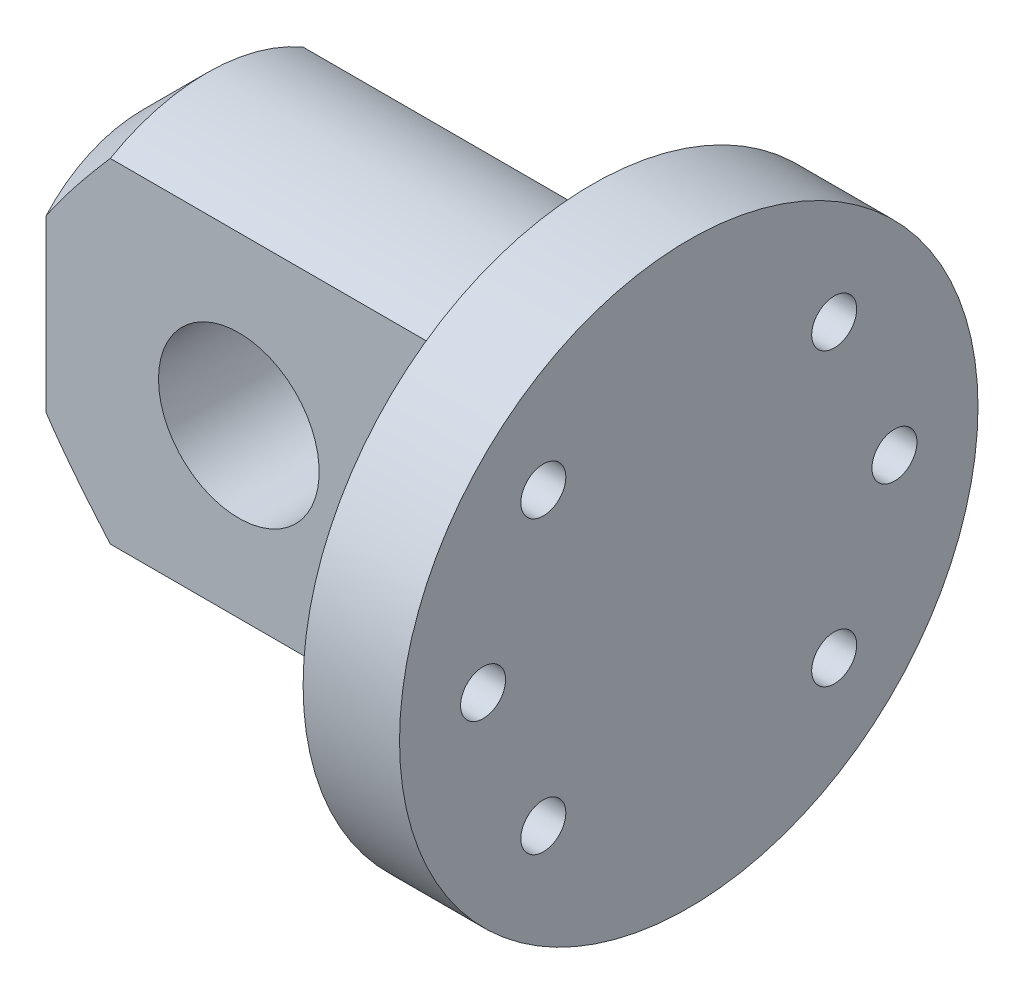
ISO-10303-21;
HEADER;
FILE_DESCRIPTION(('STEP AP214'),'2;1');
FILE_NAME('part.step','',(''),(''),'','','');
FILE_SCHEMA(('AUTOMOTIVE_DESIGN { 1 0 10303 214 1 1 1 1 }'));
ENDSEC;
DATA;
#1=APPLICATION_CONTEXT('core data for automotive mechanical design processes');
#2=APPLICATION_PROTOCOL_DEFINITION('international standard','automotive_design',2000,#1);
#3=PRODUCT_CONTEXT('',#1,'mechanical');
#4=PRODUCT('Part','Part','',(#3));
#5=PRODUCT_RELATED_PRODUCT_CATEGORY('part','',(#4));
#6=PRODUCT_DEFINITION_FORMATION('','',#4);
#7=PRODUCT_DEFINITION_CONTEXT('part definition',#1,'design');
#8=PRODUCT_DEFINITION('design','',#6,#7);
#9=PRODUCT_DEFINITION_SHAPE('','',#8);
#10=(LENGTH_UNIT() NAMED_UNIT(*) SI_UNIT(.MILLI.,.METRE.));
#11=(NAMED_UNIT(*) PLANE_ANGLE_UNIT() SI_UNIT($,.RADIAN.));
#12=(NAMED_UNIT(*) SI_UNIT($,.STERADIAN.) SOLID_ANGLE_UNIT());
#13=UNCERTAINTY_MEASURE_WITH_UNIT(LENGTH_MEASURE(1.E-05),#10,'distance_accuracy_value','');
#14=(GEOMETRIC_REPRESENTATION_CONTEXT(3) GLOBAL_UNCERTAINTY_ASSIGNED_CONTEXT((#13)) GLOBAL_UNIT_ASSIGNED_CONTEXT((#10,
#11,#12)) REPRESENTATION_CONTEXT('',''));
#15=CARTESIAN_POINT('',(0.,0.,0.));
#16=DIRECTION('',(0.,0.,1.));
#17=DIRECTION('',(1.,0.,0.));
#18=AXIS2_PLACEMENT_3D('',#15,#16,#17);
#19=CARTESIAN_POINT('',(-11.6180368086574,-21.0477458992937,0.));
#20=DIRECTION('',(1.,0.,0.));
#21=DIRECTION('',(0.,0.,-1.));
#22=AXIS2_PLACEMENT_3D('',#19,#20,#21);
#23=CONICAL_SURFACE('',#22,29.9999999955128,0.785398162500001);
#24=CARTESIAN_POINT('',(-11.6180368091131,4.93301621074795,15.0000000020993));
#25=CARTESIAN_POINT('',(-12.06039773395,4.4221694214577,15.0000000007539));
#26=CARTESIAN_POINT('',(-12.500950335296,3.90974504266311,15.000000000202));
#27=CARTESIAN_POINT('',(-13.377666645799,2.88113990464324,14.999999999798));
#28=CARTESIAN_POINT('',(-13.8138302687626,2.36495907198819,14.9999999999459));
#29=CARTESIAN_POINT('',(-14.6805685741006,1.32875044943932,15.000000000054));
#30=CARTESIAN_POINT('',(-15.1111481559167,0.808726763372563,15.0000000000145));
#31=CARTESIAN_POINT('',(-15.9661124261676,-0.236411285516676,14.9999999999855));
#32=CARTESIAN_POINT('',(-16.3904970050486,-0.761525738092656,14.9999999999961));
#33=CARTESIAN_POINT('',(-17.2320009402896,-1.81805923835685,15.0000000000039));
#34=CARTESIAN_POINT('',(-17.6491158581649,-2.34948182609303,15.000000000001));
#35=CARTESIAN_POINT('',(-18.4741037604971,-3.41942173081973,14.999999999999));
#36=CARTESIAN_POINT('',(-18.8819773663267,-3.95793856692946,14.9999999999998));
#37=CARTESIAN_POINT('',(-19.4853612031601,-4.77235024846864,15.0000000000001));
#38=CARTESIAN_POINT('',(-19.6851776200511,-5.04505798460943,15.));
#39=CARTESIAN_POINT('',(-20.0815740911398,-5.59281234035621,15.));
#40=CARTESIAN_POINT('',(-20.2781541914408,-5.86785892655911,15.));
#41=CARTESIAN_POINT('',(-20.667726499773,-6.42057968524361,15.));
#42=CARTESIAN_POINT('',(-20.8607178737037,-6.69825444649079,15.));
#43=CARTESIAN_POINT('',(-21.2425872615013,-7.25643698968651,15.));
#44=CARTESIAN_POINT('',(-21.4314650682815,-7.53694491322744,15.));
#45=CARTESIAN_POINT('',(-21.6180368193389,-7.8189893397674,15.));
#46=B_SPLINE_CURVE_WITH_KNOTS('',3,(#24,#25,#26,#27,#28,#29,#30,#31,#32,#33,#34,#35,#36,#37,#38,
#39,#40,#41,#42,#43,#44,#45),.UNSPECIFIED.,.F.,.F.,(4,2,2,2,2,2,2,2,2,2,4),(0.,2.02728019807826,
4.05460013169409,6.08000109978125,8.10543784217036,10.1320707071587,12.1585668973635,
13.1727788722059,14.1869763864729,15.2014067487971,16.2158880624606),.UNSPECIFIED.);
#47=CARTESIAN_POINT('',(-11.6180368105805,4.93301621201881,15.));
#48=VERTEX_POINT('',#47);
#49=CARTESIAN_POINT('',(-21.6180368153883,-7.8189893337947,15.));
#50=VERTEX_POINT('',#49);
#51=EDGE_CURVE('E95',#48,#50,#46,.T.);
#52=ORIENTED_EDGE('',*,*,#51,.F.);
#53=CARTESIAN_POINT('',(-11.6180368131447,-21.0477458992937,0.));
#54=DIRECTION('',(1.,0.,0.));
#55=DIRECTION('',(0.,0.,-1.));
#56=AXIS2_PLACEMENT_3D('',#53,#54,#55);
#57=CIRCLE('',#56,30.);
#58=CARTESIAN_POINT('',(-11.6180368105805,4.93301621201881,-15.));
#59=VERTEX_POINT('',#58);
#60=EDGE_CURVE('E81',#59,#48,#57,.T.);
#61=ORIENTED_EDGE('',*,*,#60,.F.);
#62=CARTESIAN_POINT('',(-21.6180368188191,-7.81898934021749,-14.9999999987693));
#63=CARTESIAN_POINT('',(-21.431465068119,-7.53694491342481,-14.999999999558));
#64=CARTESIAN_POINT('',(-21.2425872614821,-7.25643698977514,-14.9999999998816));
#65=CARTESIAN_POINT('',(-20.8607178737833,-6.69825444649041,-15.0000000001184));
#66=CARTESIAN_POINT('',(-20.6677264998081,-6.42057968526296,-15.0000000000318));
#67=CARTESIAN_POINT('',(-20.2781541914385,-5.86785892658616,-14.9999999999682));
#68=CARTESIAN_POINT('',(-20.0815740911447,-5.59281234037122,-14.9999999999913));
#69=CARTESIAN_POINT('',(-19.6851776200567,-5.04505798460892,-15.0000000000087));
#70=CARTESIAN_POINT('',(-19.4853612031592,-4.77235024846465,-15.000000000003));
#71=CARTESIAN_POINT('',(-18.8819773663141,-3.95793856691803,-14.9999999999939));
#72=CARTESIAN_POINT('',(-18.4741037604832,-3.41942173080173,-14.9999999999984));
#73=CARTESIAN_POINT('',(-17.6491158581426,-2.34948182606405,-15.0000000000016));
#74=CARTESIAN_POINT('',(-17.2320009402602,-1.81805923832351,-15.0000000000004));
#75=CARTESIAN_POINT('',(-16.390497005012,-0.761525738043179,-14.9999999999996));
#76=CARTESIAN_POINT('',(-15.9661124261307,-0.236411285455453,-14.9999999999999));
#77=CARTESIAN_POINT('',(-15.1111481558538,0.808726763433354,-15.0000000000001));
#78=CARTESIAN_POINT('',(-14.6805685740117,1.32875044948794,-15.));
#79=CARTESIAN_POINT('',(-13.8138302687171,2.36495907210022,-15.));
#80=CARTESIAN_POINT('',(-13.377666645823,2.8811399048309,-15.));
#81=CARTESIAN_POINT('',(-12.5009503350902,3.90974504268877,-15.));
#82=CARTESIAN_POINT('',(-12.060397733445,4.42216942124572,-15.));
#83=CARTESIAN_POINT('',(-11.6180368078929,4.93301620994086,-15.));
#84=B_SPLINE_CURVE_WITH_KNOTS('',3,(#62,#63,#64,#65,#66,#67,#68,#69,#70,#71,#72,#73,#74,#75,#76,
#77,#78,#79,#80,#81,#82,#83),.UNSPECIFIED.,.F.,.F.,(4,2,2,2,2,2,2,2,2,2,4),(0.,1.01448131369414,
2.02891167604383,3.04310919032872,4.05732116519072,6.08381735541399,8.11045022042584,
10.1358869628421,12.1612879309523,14.1886078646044,16.215888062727),.UNSPECIFIED.);
#85=CARTESIAN_POINT('',(-21.6180368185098,-7.81898933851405,-15.));
#86=VERTEX_POINT('',#85);
#87=EDGE_CURVE('E80',#86,#59,#84,.T.);
#88=ORIENTED_EDGE('',*,*,#87,.F.);
#89=CARTESIAN_POINT('',(-21.6180368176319,-21.0477458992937,0.));
#90=DIRECTION('',(1.,0.,0.));
#91=DIRECTION('',(0.,0.,-1.));
#92=AXIS2_PLACEMENT_3D('',#89,#90,#91);
#93=CIRCLE('',#92,20.0000000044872);
#94=EDGE_CURVE('E20',#50,#86,#93,.F.);
#95=ORIENTED_EDGE('',*,*,#94,.F.);
#96=EDGE_LOOP('',(#52,#61,#88,#95));
#97=FACE_BOUND('',#96,.T.);
#98=ADVANCED_FACE('F16',(#97),#23,.T.);
#99=CARTESIAN_POINT('',(-21.6180368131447,-6.04774589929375,0.));
#100=DIRECTION('',(-1.,0.,0.));
#101=DIRECTION('',(0.,0.,1.));
#102=AXIS2_PLACEMENT_3D('',#99,#100,#101);
#103=PLANE('',#102);
#104=DIRECTION('',(0.,1.,0.));
#105=VECTOR('',#104,1.);
#106=CARTESIAN_POINT('',(-21.6180368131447,-21.1819452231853,15.));
#107=LINE('',#106,#105);
#108=CARTESIAN_POINT('',(-21.6180368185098,-34.2765024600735,15.));
#109=VERTEX_POINT('',#108);
#110=EDGE_CURVE('E74',#50,#109,#107,.F.);
#111=ORIENTED_EDGE('',*,*,#110,.F.);
#112=ORIENTED_EDGE('',*,*,#94,.T.);
#113=DIRECTION('',(0.,1.,0.));
#114=VECTOR('',#113,1.);
#115=CARTESIAN_POINT('',(-21.6180368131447,-21.0477458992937,-15.));
#116=LINE('',#115,#114);
#117=CARTESIAN_POINT('',(-21.6180368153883,-34.2765024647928,-15.));
#118=VERTEX_POINT('',#117);
#119=EDGE_CURVE('E71',#118,#86,#116,.T.);
#120=ORIENTED_EDGE('',*,*,#119,.F.);
#121=CARTESIAN_POINT('',(-21.6180368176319,-21.0477458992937,0.));
#122=DIRECTION('',(1.,0.,0.));
#123=DIRECTION('',(0.,0.,-1.));
#124=AXIS2_PLACEMENT_3D('',#121,#122,#123);
#125=CIRCLE('',#124,20.0000000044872);
#126=EDGE_CURVE('E78',#109,#118,#125,.T.);
#127=ORIENTED_EDGE('',*,*,#126,.F.);
#128=EDGE_LOOP('',(#111,#112,#120,#127));
#129=FACE_BOUND('',#128,.T.);
#130=ADVANCED_FACE('F69',(#129),#103,.T.);
#131=CARTESIAN_POINT('',(8.38196318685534,-21.0477458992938,15.));
#132=DIRECTION('',(0.,0.,-1.));
#133=DIRECTION('',(-1.,0.,0.));
#134=AXIS2_PLACEMENT_3D('',#131,#132,#133);
#135=CYLINDRICAL_SURFACE('',#134,12.5);
#136=CARTESIAN_POINT('',(8.38196318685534,-21.0477458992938,15.));
#137=DIRECTION('',(0.,0.,-1.));
#138=DIRECTION('',(-1.,0.,0.));
#139=AXIS2_PLACEMENT_3D('',#136,#137,#138);
#140=CIRCLE('',#139,12.5);
#141=CARTESIAN_POINT('',(-4.11803681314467,-21.0477458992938,15.));
#142=VERTEX_POINT('',#141);
#143=EDGE_CURVE('E131',#142,#142,#140,.T.);
#144=ORIENTED_EDGE('',*,*,#143,.F.);
#145=EDGE_LOOP('',(#144));
#146=FACE_BOUND('',#145,.T.);
#147=CARTESIAN_POINT('',(8.38196318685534,-21.0477458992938,-15.));
#148=DIRECTION('',(0.,0.,-1.));
#149=DIRECTION('',(-1.,0.,0.));
#150=AXIS2_PLACEMENT_3D('',#147,#148,#149);
#151=CIRCLE('',#150,12.5);
#152=CARTESIAN_POINT('',(-4.11803681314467,-21.0477458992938,-15.));
#153=VERTEX_POINT('',#152);
#154=EDGE_CURVE('E85',#153,#153,#151,.F.);
#155=ORIENTED_EDGE('',*,*,#154,.F.);
#156=EDGE_LOOP('',(#155));
#157=FACE_BOUND('',#156,.T.);
#158=ADVANCED_FACE('F202',(#146,#157),#135,.F.);
#159=CARTESIAN_POINT('',(-11.6180368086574,-21.0477458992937,0.));
#160=DIRECTION('',(1.,0.,0.));
#161=DIRECTION('',(0.,0.,-1.));
#162=AXIS2_PLACEMENT_3D('',#159,#160,#161);
#163=CONICAL_SURFACE('',#162,29.9999999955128,0.785398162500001);
#164=CARTESIAN_POINT('',(-11.6180368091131,-47.0285080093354,-15.0000000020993));
#165=CARTESIAN_POINT('',(-12.06039773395,-46.5176612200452,-15.0000000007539));
#166=CARTESIAN_POINT('',(-12.500950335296,-46.0052368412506,-15.000000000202));
#167=CARTESIAN_POINT('',(-13.377666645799,-44.9766317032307,-14.999999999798));
#168=CARTESIAN_POINT('',(-13.8138302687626,-44.4604508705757,-14.9999999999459));
#169=CARTESIAN_POINT('',(-14.6805685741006,-43.4242422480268,-15.000000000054));
#170=CARTESIAN_POINT('',(-15.1111481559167,-42.9042185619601,-15.0000000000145));
#171=CARTESIAN_POINT('',(-15.9661124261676,-41.8590805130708,-14.9999999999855));
#172=CARTESIAN_POINT('',(-16.3904970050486,-41.3339660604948,-14.9999999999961));
#173=CARTESIAN_POINT('',(-17.2320009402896,-40.2774325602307,-15.0000000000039));
#174=CARTESIAN_POINT('',(-17.6491158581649,-39.7460099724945,-15.000000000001));
#175=CARTESIAN_POINT('',(-18.4741037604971,-38.6760700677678,-14.999999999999));
#176=CARTESIAN_POINT('',(-18.8819773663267,-38.137553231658,-14.9999999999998));
#177=CARTESIAN_POINT('',(-19.4853612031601,-37.3231415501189,-15.0000000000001));
#178=CARTESIAN_POINT('',(-19.6851776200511,-37.0504338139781,-15.));
#179=CARTESIAN_POINT('',(-20.0815740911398,-36.5026794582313,-15.));
#180=CARTESIAN_POINT('',(-20.2781541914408,-36.2276328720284,-15.));
#181=CARTESIAN_POINT('',(-20.667726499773,-35.6749121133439,-15.));
#182=CARTESIAN_POINT('',(-20.8607178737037,-35.3972373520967,-15.));
#183=CARTESIAN_POINT('',(-21.2425872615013,-34.839054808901,-15.));
#184=CARTESIAN_POINT('',(-21.4314650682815,-34.5585468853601,-15.));
#185=CARTESIAN_POINT('',(-21.6180368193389,-34.2765024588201,-15.));
#186=B_SPLINE_CURVE_WITH_KNOTS('',3,(#164,#165,#166,#167,#168,#169,#170,#171,#172,#173,#174,
#175,#176,#177,#178,#179,#180,#181,#182,#183,#184,#185),.UNSPECIFIED.,.F.,.F.,(4,2,2,2,2,2,2,2,
2,2,4),(0.,2.02728019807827,4.05460013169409,6.08000109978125,8.10543784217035,10.1320707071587,
12.1585668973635,13.1727788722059,14.1869763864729,15.2014067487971,16.2158880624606),.UNSPECIFIED.);
#187=CARTESIAN_POINT('',(-11.6180368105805,-47.0285080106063,-15.));
#188=VERTEX_POINT('',#187);
#189=EDGE_CURVE('E89',#188,#118,#186,.T.);
#190=ORIENTED_EDGE('',*,*,#189,.F.);
#191=CARTESIAN_POINT('',(-11.6180368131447,-21.0477458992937,0.));
#192=DIRECTION('',(1.,0.,0.));
#193=DIRECTION('',(0.,0.,-1.));
#194=AXIS2_PLACEMENT_3D('',#191,#192,#193);
#195=CIRCLE('',#194,30.);
#196=CARTESIAN_POINT('',(-11.6180368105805,-47.0285080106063,15.));
#197=VERTEX_POINT('',#196);
#198=EDGE_CURVE('E128',#197,#188,#195,.T.);
#199=ORIENTED_EDGE('',*,*,#198,.F.);
#200=CARTESIAN_POINT('',(-21.6180368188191,-34.27650245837,14.9999999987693));
#201=CARTESIAN_POINT('',(-21.431465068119,-34.5585468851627,14.999999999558));
#202=CARTESIAN_POINT('',(-21.2425872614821,-34.8390548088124,14.9999999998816));
#203=CARTESIAN_POINT('',(-20.8607178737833,-35.3972373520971,15.0000000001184));
#204=CARTESIAN_POINT('',(-20.6677264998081,-35.6749121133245,15.0000000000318));
#205=CARTESIAN_POINT('',(-20.2781541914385,-36.2276328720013,14.9999999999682));
#206=CARTESIAN_POINT('',(-20.0815740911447,-36.5026794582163,14.9999999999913));
#207=CARTESIAN_POINT('',(-19.6851776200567,-37.0504338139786,15.0000000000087));
#208=CARTESIAN_POINT('',(-19.4853612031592,-37.3231415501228,15.000000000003));
#209=CARTESIAN_POINT('',(-18.8819773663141,-38.1375532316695,14.9999999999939));
#210=CARTESIAN_POINT('',(-18.4741037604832,-38.6760700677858,14.9999999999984));
#211=CARTESIAN_POINT('',(-17.6491158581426,-39.7460099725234,15.0000000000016));
#212=CARTESIAN_POINT('',(-17.2320009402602,-40.277432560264,15.0000000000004));
#213=CARTESIAN_POINT('',(-16.390497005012,-41.3339660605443,14.9999999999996));
#214=CARTESIAN_POINT('',(-15.9661124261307,-41.859080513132,14.9999999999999));
#215=CARTESIAN_POINT('',(-15.1111481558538,-42.9042185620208,15.0000000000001));
#216=CARTESIAN_POINT('',(-14.6805685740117,-43.4242422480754,15.));
#217=CARTESIAN_POINT('',(-13.8138302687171,-44.4604508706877,15.));
#218=CARTESIAN_POINT('',(-13.3776666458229,-44.9766317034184,15.));
#219=CARTESIAN_POINT('',(-12.5009503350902,-46.0052368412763,15.));
#220=CARTESIAN_POINT('',(-12.060397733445,-46.5176612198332,15.));
#221=CARTESIAN_POINT('',(-11.6180368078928,-47.0285080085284,15.));
#222=B_SPLINE_CURVE_WITH_KNOTS('',3,(#200,#201,#202,#203,#204,#205,#206,#207,#208,#209,#210,
#211,#212,#213,#214,#215,#216,#217,#218,#219,#220,#221),.UNSPECIFIED.,.F.,.F.,(4,2,2,2,2,2,2,2,
2,2,4),(0.,1.01448131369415,2.02891167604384,3.04310919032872,4.05732116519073,6.083817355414,
8.11045022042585,10.1358869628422,12.1612879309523,14.1886078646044,16.215888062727),.UNSPECIFIED.);
#223=EDGE_CURVE('E94',#109,#197,#222,.T.);
#224=ORIENTED_EDGE('',*,*,#223,.F.);
#225=ORIENTED_EDGE('',*,*,#126,.T.);
#226=EDGE_LOOP('',(#190,#199,#224,#225));
#227=FACE_BOUND('',#226,.T.);
#228=ADVANCED_FACE('F198',(#227),#163,.T.);
#229=CARTESIAN_POINT('',(-21.6180368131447,4.93301621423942,-15.));
#230=DIRECTION('',(0.,0.,-1.));
#231=DIRECTION('',(1.,0.,0.));
#232=AXIS2_PLACEMENT_3D('',#229,#230,#231);
#233=PLANE('',#232);
#234=ORIENTED_EDGE('',*,*,#154,.T.);
#235=EDGE_LOOP('',(#234));
#236=FACE_BOUND('',#235,.T.);
#237=DIRECTION('',(1.,0.,0.));
#238=VECTOR('',#237,1.);
#239=CARTESIAN_POINT('',(13.3819631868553,4.93301621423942,-15.));
#240=LINE('',#239,#238);
#241=CARTESIAN_POINT('',(48.3819631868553,4.93301621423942,-15.));
#242=VERTEX_POINT('',#241);
#243=EDGE_CURVE('E132',#242,#59,#240,.F.);
#244=ORIENTED_EDGE('',*,*,#243,.F.);
#245=DIRECTION('',(0.,1.,0.));
#246=VECTOR('',#245,1.);
#247=CARTESIAN_POINT('',(48.3819631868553,16.4522541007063,-15.));
#248=LINE('',#247,#246);
#249=CARTESIAN_POINT('',(48.3819631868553,-47.0285080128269,-15.));
#250=VERTEX_POINT('',#249);
#251=EDGE_CURVE('E103',#250,#242,#248,.T.);
#252=ORIENTED_EDGE('',*,*,#251,.F.);
#253=DIRECTION('',(1.,0.,0.));
#254=VECTOR('',#253,1.);
#255=CARTESIAN_POINT('',(13.3819631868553,-47.0285080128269,-15.));
#256=LINE('',#255,#254);
#257=EDGE_CURVE('E106',#188,#250,#256,.T.);
#258=ORIENTED_EDGE('',*,*,#257,.F.);
#259=ORIENTED_EDGE('',*,*,#189,.T.);
#260=ORIENTED_EDGE('',*,*,#119,.T.);
#261=ORIENTED_EDGE('',*,*,#87,.T.);
#262=EDGE_LOOP('',(#244,#252,#258,#259,#260,#261));
#263=FACE_BOUND('',#262,.T.);
#264=ADVANCED_FACE('F87',(#236,#263),#233,.T.);
#265=CARTESIAN_POINT('',(13.3819631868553,-21.0477458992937,0.));
#266=DIRECTION('',(1.,0.,0.));
#267=DIRECTION('',(0.,0.,-1.));
#268=AXIS2_PLACEMENT_3D('',#265,#266,#267);
#269=CYLINDRICAL_SURFACE('',#268,30.);
#270=DIRECTION('',(1.,0.,0.));
#271=VECTOR('',#270,1.);
#272=CARTESIAN_POINT('',(10.0696850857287,4.93301621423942,15.));
#273=LINE('',#272,#271);
#274=CARTESIAN_POINT('',(48.3819631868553,4.93301621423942,15.));
#275=VERTEX_POINT('',#274);
#276=EDGE_CURVE('E96',#275,#48,#273,.F.);
#277=ORIENTED_EDGE('',*,*,#276,.F.);
#278=CARTESIAN_POINT('',(48.3819631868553,-21.0477458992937,0.));
#279=DIRECTION('',(1.,0.,0.));
#280=DIRECTION('',(0.,0.,-1.));
#281=AXIS2_PLACEMENT_3D('',#278,#279,#280);
#282=CIRCLE('',#281,30.);
#283=EDGE_CURVE('E102',#242,#275,#282,.T.);
#284=ORIENTED_EDGE('',*,*,#283,.F.);
#285=ORIENTED_EDGE('',*,*,#243,.T.);
#286=ORIENTED_EDGE('',*,*,#60,.T.);
#287=EDGE_LOOP('',(#277,#284,#285,#286));
#288=FACE_BOUND('',#287,.T.);
#289=ADVANCED_FACE('F204',(#288),#269,.T.);
#290=CARTESIAN_POINT('',(10.0696850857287,-21.1819452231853,15.));
#291=DIRECTION('',(0.,0.,1.));
#292=DIRECTION('',(1.,0.,0.));
#293=AXIS2_PLACEMENT_3D('',#290,#291,#292);
#294=PLANE('',#293);
#295=ORIENTED_EDGE('',*,*,#143,.T.);
#296=EDGE_LOOP('',(#295));
#297=FACE_BOUND('',#296,.T.);
#298=DIRECTION('',(1.,0.,0.));
#299=VECTOR('',#298,1.);
#300=CARTESIAN_POINT('',(13.3819631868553,-47.0285080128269,15.));
#301=LINE('',#300,#299);
#302=CARTESIAN_POINT('',(48.3819631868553,-47.0285080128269,15.));
#303=VERTEX_POINT('',#302);
#304=EDGE_CURVE('E129',#303,#197,#301,.F.);
#305=ORIENTED_EDGE('',*,*,#304,.F.);
#306=DIRECTION('',(0.,1.,0.));
#307=VECTOR('',#306,1.);
#308=CARTESIAN_POINT('',(48.3819631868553,16.4522541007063,15.));
#309=LINE('',#308,#307);
#310=EDGE_CURVE('E99',#275,#303,#309,.F.);
#311=ORIENTED_EDGE('',*,*,#310,.F.);
#312=ORIENTED_EDGE('',*,*,#276,.T.);
#313=ORIENTED_EDGE('',*,*,#51,.T.);
#314=ORIENTED_EDGE('',*,*,#110,.T.);
#315=ORIENTED_EDGE('',*,*,#223,.T.);
#316=EDGE_LOOP('',(#305,#311,#312,#313,#314,#315));
#317=FACE_BOUND('',#316,.T.);
#318=ADVANCED_FACE('F194',(#297,#317),#294,.T.);
#319=CARTESIAN_POINT('',(13.3819631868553,-21.0477458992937,0.));
#320=DIRECTION('',(1.,0.,0.));
#321=DIRECTION('',(0.,0.,-1.));
#322=AXIS2_PLACEMENT_3D('',#319,#320,#321);
#323=CYLINDRICAL_SURFACE('',#322,30.);
#324=ORIENTED_EDGE('',*,*,#257,.T.);
#325=CARTESIAN_POINT('',(48.3819631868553,-21.0477458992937,0.));
#326=DIRECTION('',(1.,0.,0.));
#327=DIRECTION('',(0.,0.,-1.));
#328=AXIS2_PLACEMENT_3D('',#325,#326,#327);
#329=CIRCLE('',#328,30.);
#330=EDGE_CURVE('E35',#303,#250,#329,.T.);
#331=ORIENTED_EDGE('',*,*,#330,.F.);
#332=ORIENTED_EDGE('',*,*,#304,.T.);
#333=ORIENTED_EDGE('',*,*,#198,.T.);
#334=EDGE_LOOP('',(#324,#331,#332,#333));
#335=FACE_BOUND('',#334,.T.);
#336=ADVANCED_FACE('F280',(#335),#323,.T.);
#337=CARTESIAN_POINT('',(48.3819631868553,16.4522541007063,0.));
#338=DIRECTION('',(-1.,0.,0.));
#339=DIRECTION('',(0.,0.,1.));
#340=AXIS2_PLACEMENT_3D('',#337,#338,#339);
#341=PLANE('',#340);
#342=CARTESIAN_POINT('',(48.3819631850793,-21.0477458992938,-32.));
#343=DIRECTION('',(-1.,0.,0.));
#344=DIRECTION('',(0.,0.,1.));
#345=AXIS2_PLACEMENT_3D('',#342,#343,#344);
#346=CIRCLE('',#345,7.49999999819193);
#347=CARTESIAN_POINT('',(48.3819631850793,-21.0477458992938,-24.5000000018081));
#348=VERTEX_POINT('',#347);
#349=EDGE_CURVE('E168',#348,#348,#346,.F.);
#350=ORIENTED_EDGE('',*,*,#349,.T.);
#351=EDGE_LOOP('',(#350));
#352=FACE_BOUND('',#351,.T.);
#353=CARTESIAN_POINT('',(48.3819631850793,-43.6751628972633,22.6274169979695));
#354=DIRECTION('',(-1.,0.,0.));
#355=DIRECTION('',(0.,0.,1.));
#356=AXIS2_PLACEMENT_3D('',#353,#354,#355);
#357=CIRCLE('',#356,7.4999999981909);
#358=CARTESIAN_POINT('',(48.3819631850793,-43.6751628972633,30.1274169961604));
#359=VERTEX_POINT('',#358);
#360=EDGE_CURVE('E165',#359,#359,#357,.F.);
#361=ORIENTED_EDGE('',*,*,#360,.T.);
#362=EDGE_LOOP('',(#361));
#363=FACE_BOUND('',#362,.T.);
#364=CARTESIAN_POINT('',(48.3819631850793,1.57967109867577,22.6274169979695));
#365=DIRECTION('',(-1.,0.,0.));
#366=DIRECTION('',(0.,0.,1.));
#367=AXIS2_PLACEMENT_3D('',#364,#365,#366);
#368=CIRCLE('',#367,7.49999999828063);
#369=CARTESIAN_POINT('',(48.3819631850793,1.57967109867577,30.1274169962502));
#370=VERTEX_POINT('',#369);
#371=EDGE_CURVE('E162',#370,#370,#368,.F.);
#372=ORIENTED_EDGE('',*,*,#371,.T.);
#373=EDGE_LOOP('',(#372));
#374=FACE_BOUND('',#373,.T.);
#375=ORIENTED_EDGE('',*,*,#310,.T.);
#376=ORIENTED_EDGE('',*,*,#330,.T.);
#377=ORIENTED_EDGE('',*,*,#251,.T.);
#378=ORIENTED_EDGE('',*,*,#283,.T.);
#379=EDGE_LOOP('',(#375,#376,#377,#378));
#380=FACE_BOUND('',#379,.T.);
#381=CARTESIAN_POINT('',(48.3819631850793,-21.0477458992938,32.));
#382=DIRECTION('',(-1.,0.,0.));
#383=DIRECTION('',(0.,0.,1.));
#384=AXIS2_PLACEMENT_3D('',#381,#382,#383);
#385=CIRCLE('',#384,7.49999999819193);
#386=CARTESIAN_POINT('',(48.3819631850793,-21.0477458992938,39.4999999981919));
#387=VERTEX_POINT('',#386);
#388=EDGE_CURVE('E159',#387,#387,#385,.F.);
#389=ORIENTED_EDGE('',*,*,#388,.T.);
#390=EDGE_LOOP('',(#389));
#391=FACE_BOUND('',#390,.T.);
#392=CARTESIAN_POINT('',(48.3819631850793,-43.6751628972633,-22.6274169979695));
#393=DIRECTION('',(-1.,0.,0.));
#394=DIRECTION('',(0.,0.,1.));
#395=AXIS2_PLACEMENT_3D('',#392,#393,#394);
#396=CIRCLE('',#395,7.4999999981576);
#397=CARTESIAN_POINT('',(48.3819631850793,-43.6751628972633,-15.1274169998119));
#398=VERTEX_POINT('',#397);
#399=EDGE_CURVE('E174',#398,#398,#396,.F.);
#400=ORIENTED_EDGE('',*,*,#399,.T.);
#401=EDGE_LOOP('',(#400));
#402=FACE_BOUND('',#401,.T.);
#403=CARTESIAN_POINT('',(48.3819631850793,1.57967109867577,-22.6274169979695));
#404=DIRECTION('',(-1.,0.,0.));
#405=DIRECTION('',(0.,0.,1.));
#406=AXIS2_PLACEMENT_3D('',#403,#404,#405);
#407=CIRCLE('',#406,7.49999999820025);
#408=CARTESIAN_POINT('',(48.3819631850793,1.57967109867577,-15.1274169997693));
#409=VERTEX_POINT('',#408);
#410=EDGE_CURVE('E171',#409,#409,#407,.F.);
#411=ORIENTED_EDGE('',*,*,#410,.T.);
#412=EDGE_LOOP('',(#411));
#413=FACE_BOUND('',#412,.T.);
#414=CARTESIAN_POINT('',(48.3819631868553,-21.0477458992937,0.));
#415=DIRECTION('',(1.,0.,0.));
#416=DIRECTION('',(0.,0.,-1.));
#417=AXIS2_PLACEMENT_3D('',#414,#415,#416);
#418=CIRCLE('',#417,45.);
#419=CARTESIAN_POINT('',(48.3819631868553,-21.0477458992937,-45.));
#420=VERTEX_POINT('',#419);
#421=EDGE_CURVE('E126',#420,#420,#418,.T.);
#422=ORIENTED_EDGE('',*,*,#421,.F.);
#423=EDGE_LOOP('',(#422));
#424=FACE_BOUND('',#423,.T.);
#425=ADVANCED_FACE('F277',(#352,#363,#374,#380,#391,#402,#413,#424),#341,.T.);
#426=CARTESIAN_POINT('',(48.3819631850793,-43.6751628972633,-22.6274169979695));
#427=DIRECTION('',(-1.,0.,0.));
#428=DIRECTION('',(0.,0.,1.));
#429=AXIS2_PLACEMENT_3D('',#426,#427,#428);
#430=CONICAL_SURFACE('',#429,7.4999999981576,0.785398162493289);
#431=CARTESIAN_POINT('',(52.3819631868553,-43.6751628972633,-22.6274169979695));
#432=DIRECTION('',(1.,0.,0.));
#433=DIRECTION('',(0.,0.,-1.));
#434=AXIS2_PLACEMENT_3D('',#431,#432,#433);
#435=CIRCLE('',#434,3.5);
#436=CARTESIAN_POINT('',(52.3819631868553,-43.6751628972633,-26.1274169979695));
#437=VERTEX_POINT('',#436);
#438=EDGE_CURVE('E123',#437,#437,#435,.T.);
#439=ORIENTED_EDGE('',*,*,#438,.T.);
#440=EDGE_LOOP('',(#439));
#441=FACE_BOUND('',#440,.T.);
#442=ORIENTED_EDGE('',*,*,#399,.F.);
#443=EDGE_LOOP('',(#442));
#444=FACE_BOUND('',#443,.T.);
#445=ADVANCED_FACE('F273',(#441,#444),#430,.F.);
#446=CARTESIAN_POINT('',(48.3819631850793,1.57967109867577,-22.6274169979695));
#447=DIRECTION('',(-1.,0.,0.));
#448=DIRECTION('',(0.,0.,1.));
#449=AXIS2_PLACEMENT_3D('',#446,#447,#448);
#450=CONICAL_SURFACE('',#449,7.49999999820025,0.785398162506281);
#451=CARTESIAN_POINT('',(52.3819631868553,1.57967109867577,-22.6274169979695));
#452=DIRECTION('',(1.,0.,0.));
#453=DIRECTION('',(0.,0.,-1.));
#454=AXIS2_PLACEMENT_3D('',#451,#452,#453);
#455=CIRCLE('',#454,3.5);
#456=CARTESIAN_POINT('',(52.3819631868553,1.57967109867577,-26.1274169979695));
#457=VERTEX_POINT('',#456);
#458=EDGE_CURVE('E120',#457,#457,#455,.T.);
#459=ORIENTED_EDGE('',*,*,#458,.T.);
#460=EDGE_LOOP('',(#459));
#461=FACE_BOUND('',#460,.T.);
#462=ORIENTED_EDGE('',*,*,#410,.F.);
#463=EDGE_LOOP('',(#462));
#464=FACE_BOUND('',#463,.T.);
#465=ADVANCED_FACE('F269',(#461,#464),#450,.F.);
#466=CARTESIAN_POINT('',(48.3819631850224,-21.0477458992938,-32.));
#467=DIRECTION('',(-1.,0.,0.));
#468=DIRECTION('',(0.,0.,1.));
#469=AXIS2_PLACEMENT_3D('',#466,#467,#468);
#470=CONICAL_SURFACE('',#469,7.49999999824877,0.785398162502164);
#471=CARTESIAN_POINT('',(52.3819631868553,-21.0477458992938,-32.));
#472=DIRECTION('',(1.,0.,0.));
#473=DIRECTION('',(0.,0.,-1.));
#474=AXIS2_PLACEMENT_3D('',#471,#472,#473);
#475=CIRCLE('',#474,3.5);
#476=CARTESIAN_POINT('',(52.3819631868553,-21.0477458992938,-35.5));
#477=VERTEX_POINT('',#476);
#478=EDGE_CURVE('E117',#477,#477,#475,.T.);
#479=ORIENTED_EDGE('',*,*,#478,.T.);
#480=EDGE_LOOP('',(#479));
#481=FACE_BOUND('',#480,.T.);
#482=ORIENTED_EDGE('',*,*,#349,.F.);
#483=EDGE_LOOP('',(#482));
#484=FACE_BOUND('',#483,.T.);
#485=ADVANCED_FACE('F265',(#481,#484),#470,.F.);
#486=CARTESIAN_POINT('',(48.3819631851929,-43.6751628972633,22.6274169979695));
#487=DIRECTION('',(-1.,0.,0.));
#488=DIRECTION('',(0.,0.,1.));
#489=AXIS2_PLACEMENT_3D('',#486,#487,#488);
#490=CONICAL_SURFACE('',#489,7.49999999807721,0.785398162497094);
#491=CARTESIAN_POINT('',(52.3819631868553,-43.6751628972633,22.6274169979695));
#492=DIRECTION('',(1.,0.,0.));
#493=DIRECTION('',(0.,0.,-1.));
#494=AXIS2_PLACEMENT_3D('',#491,#492,#493);
#495=CIRCLE('',#494,3.5);
#496=CARTESIAN_POINT('',(52.3819631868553,-43.6751628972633,19.1274169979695));
#497=VERTEX_POINT('',#496);
#498=EDGE_CURVE('E114',#497,#497,#495,.T.);
#499=ORIENTED_EDGE('',*,*,#498,.T.);
#500=EDGE_LOOP('',(#499));
#501=FACE_BOUND('',#500,.T.);
#502=ORIENTED_EDGE('',*,*,#360,.F.);
#503=EDGE_LOOP('',(#502));
#504=FACE_BOUND('',#503,.T.);
#505=ADVANCED_FACE('F261',(#501,#504),#490,.F.);
#506=CARTESIAN_POINT('',(48.3819631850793,1.57967109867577,22.6274169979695));
#507=DIRECTION('',(-1.,0.,0.));
#508=DIRECTION('',(0.,0.,1.));
#509=AXIS2_PLACEMENT_3D('',#506,#507,#508);
#510=CONICAL_SURFACE('',#509,7.49999999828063,0.7853981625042);
#511=CARTESIAN_POINT('',(52.3819631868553,1.57967109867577,22.6274169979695));
#512=DIRECTION('',(1.,0.,0.));
#513=DIRECTION('',(0.,1.,0.));
#514=AXIS2_PLACEMENT_3D('',#511,#512,#513);
#515=CIRCLE('',#514,3.5);
#516=CARTESIAN_POINT('',(52.3819631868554,5.07967109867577,22.6274169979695));
#517=VERTEX_POINT('',#516);
#518=EDGE_CURVE('E111',#517,#517,#515,.T.);
#519=ORIENTED_EDGE('',*,*,#518,.T.);
#520=EDGE_LOOP('',(#519));
#521=FACE_BOUND('',#520,.T.);
#522=ORIENTED_EDGE('',*,*,#371,.F.);
#523=EDGE_LOOP('',(#522));
#524=FACE_BOUND('',#523,.T.);
#525=ADVANCED_FACE('F257',(#521,#524),#510,.F.);
#526=CARTESIAN_POINT('',(48.3819631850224,-21.0477458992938,32.));
#527=DIRECTION('',(-1.,0.,0.));
#528=DIRECTION('',(0.,0.,1.));
#529=AXIS2_PLACEMENT_3D('',#526,#527,#528);
#530=CONICAL_SURFACE('',#529,7.49999999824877,0.785398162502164);
#531=CARTESIAN_POINT('',(52.3819631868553,-21.0477458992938,32.));
#532=DIRECTION('',(1.,0.,0.));
#533=DIRECTION('',(0.,0.,-1.));
#534=AXIS2_PLACEMENT_3D('',#531,#532,#533);
#535=CIRCLE('',#534,3.5);
#536=CARTESIAN_POINT('',(52.3819631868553,-21.0477458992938,28.5));
#537=VERTEX_POINT('',#536);
#538=EDGE_CURVE('E107',#537,#537,#535,.T.);
#539=ORIENTED_EDGE('',*,*,#538,.T.);
#540=EDGE_LOOP('',(#539));
#541=FACE_BOUND('',#540,.T.);
#542=ORIENTED_EDGE('',*,*,#388,.F.);
#543=EDGE_LOOP('',(#542));
#544=FACE_BOUND('',#543,.T.);
#545=ADVANCED_FACE('F253',(#541,#544),#530,.F.);
#546=CARTESIAN_POINT('',(55.8819631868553,-21.0477458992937,0.));
#547=DIRECTION('',(1.,0.,0.));
#548=DIRECTION('',(0.,0.,-1.));
#549=AXIS2_PLACEMENT_3D('',#546,#547,#548);
#550=CYLINDRICAL_SURFACE('',#549,45.);
#551=CARTESIAN_POINT('',(63.3819631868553,-21.0477458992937,0.));
#552=DIRECTION('',(1.,0.,0.));
#553=DIRECTION('',(0.,0.,-1.));
#554=AXIS2_PLACEMENT_3D('',#551,#552,#553);
#555=CIRCLE('',#554,45.);
#556=CARTESIAN_POINT('',(63.3819631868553,-21.0477458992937,-45.));
#557=VERTEX_POINT('',#556);
#558=EDGE_CURVE('E110',#557,#557,#555,.T.);
#559=ORIENTED_EDGE('',*,*,#558,.F.);
#560=EDGE_LOOP('',(#559));
#561=FACE_BOUND('',#560,.T.);
#562=ORIENTED_EDGE('',*,*,#421,.T.);
#563=EDGE_LOOP('',(#562));
#564=FACE_BOUND('',#563,.T.);
#565=ADVANCED_FACE('F249',(#561,#564),#550,.T.);
#566=CARTESIAN_POINT('',(201.434241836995,-43.6751628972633,-22.6274169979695));
#567=DIRECTION('',(1.,0.,0.));
#568=DIRECTION('',(0.,0.,-1.));
#569=AXIS2_PLACEMENT_3D('',#566,#567,#568);
#570=CYLINDRICAL_SURFACE('',#569,3.5);
#571=ORIENTED_EDGE('',*,*,#438,.F.);
#572=EDGE_LOOP('',(#571));
#573=FACE_BOUND('',#572,.T.);
#574=CARTESIAN_POINT('',(63.3819631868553,-43.6751628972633,-22.6274169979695));
#575=DIRECTION('',(1.,0.,0.));
#576=DIRECTION('',(0.,0.,-1.));
#577=AXIS2_PLACEMENT_3D('',#574,#575,#576);
#578=CIRCLE('',#577,3.5);
#579=CARTESIAN_POINT('',(63.3819631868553,-43.6751628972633,-26.1274169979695));
#580=VERTEX_POINT('',#579);
#581=EDGE_CURVE('E152',#580,#580,#578,.F.);
#582=ORIENTED_EDGE('',*,*,#581,.F.);
#583=EDGE_LOOP('',(#582));
#584=FACE_BOUND('',#583,.T.);
#585=ADVANCED_FACE('F245',(#573,#584),#570,.F.);
#586=CARTESIAN_POINT('',(201.434241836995,1.57967109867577,-22.6274169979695));
#587=DIRECTION('',(1.,0.,0.));
#588=DIRECTION('',(0.,0.,-1.));
#589=AXIS2_PLACEMENT_3D('',#586,#587,#588);
#590=CYLINDRICAL_SURFACE('',#589,3.5);
#591=ORIENTED_EDGE('',*,*,#458,.F.);
#592=EDGE_LOOP('',(#591));
#593=FACE_BOUND('',#592,.T.);
#594=CARTESIAN_POINT('',(63.3819631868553,1.57967109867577,-22.6274169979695));
#595=DIRECTION('',(1.,0.,0.));
#596=DIRECTION('',(0.,0.,-1.));
#597=AXIS2_PLACEMENT_3D('',#594,#595,#596);
#598=CIRCLE('',#597,3.5);
#599=CARTESIAN_POINT('',(63.3819631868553,1.57967109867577,-26.1274169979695));
#600=VERTEX_POINT('',#599);
#601=EDGE_CURVE('E149',#600,#600,#598,.F.);
#602=ORIENTED_EDGE('',*,*,#601,.F.);
#603=EDGE_LOOP('',(#602));
#604=FACE_BOUND('',#603,.T.);
#605=ADVANCED_FACE('F241',(#593,#604),#590,.F.);
#606=CARTESIAN_POINT('',(201.434241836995,-21.0477458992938,-32.));
#607=DIRECTION('',(1.,0.,0.));
#608=DIRECTION('',(0.,0.,-1.));
#609=AXIS2_PLACEMENT_3D('',#606,#607,#608);
#610=CYLINDRICAL_SURFACE('',#609,3.5);
#611=ORIENTED_EDGE('',*,*,#478,.F.);
#612=EDGE_LOOP('',(#611));
#613=FACE_BOUND('',#612,.T.);
#614=CARTESIAN_POINT('',(63.3819631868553,-21.0477458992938,-32.));
#615=DIRECTION('',(1.,0.,0.));
#616=DIRECTION('',(0.,0.,-1.));
#617=AXIS2_PLACEMENT_3D('',#614,#615,#616);
#618=CIRCLE('',#617,3.5);
#619=CARTESIAN_POINT('',(63.3819631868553,-21.0477458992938,-35.5));
#620=VERTEX_POINT('',#619);
#621=EDGE_CURVE('E146',#620,#620,#618,.F.);
#622=ORIENTED_EDGE('',*,*,#621,.F.);
#623=EDGE_LOOP('',(#622));
#624=FACE_BOUND('',#623,.T.);
#625=ADVANCED_FACE('F223',(#613,#624),#610,.F.);
#626=CARTESIAN_POINT('',(52.3819631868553,-43.6751628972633,22.6274169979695));
#627=DIRECTION('',(1.,0.,0.));
#628=DIRECTION('',(0.,0.,-1.));
#629=AXIS2_PLACEMENT_3D('',#626,#627,#628);
#630=CYLINDRICAL_SURFACE('',#629,3.5);
#631=ORIENTED_EDGE('',*,*,#498,.F.);
#632=EDGE_LOOP('',(#631));
#633=FACE_BOUND('',#632,.T.);
#634=CARTESIAN_POINT('',(63.3819631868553,-43.6751628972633,22.6274169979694));
#635=DIRECTION('',(1.,0.,0.));
#636=DIRECTION('',(0.,0.,-1.));
#637=AXIS2_PLACEMENT_3D('',#634,#635,#636);
#638=CIRCLE('',#637,3.5);
#639=CARTESIAN_POINT('',(63.3819631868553,-43.6751628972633,19.1274169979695));
#640=VERTEX_POINT('',#639);
#641=EDGE_CURVE('E143',#640,#640,#638,.F.);
#642=ORIENTED_EDGE('',*,*,#641,.F.);
#643=EDGE_LOOP('',(#642));
#644=FACE_BOUND('',#643,.T.);
#645=ADVANCED_FACE('F219',(#633,#644),#630,.F.);
#646=CARTESIAN_POINT('',(52.3819631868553,1.57967109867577,22.6274169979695));
#647=DIRECTION('',(1.,0.,0.));
#648=DIRECTION('',(0.,1.,0.));
#649=AXIS2_PLACEMENT_3D('',#646,#647,#648);
#650=CYLINDRICAL_SURFACE('',#649,3.5);
#651=ORIENTED_EDGE('',*,*,#518,.F.);
#652=EDGE_LOOP('',(#651));
#653=FACE_BOUND('',#652,.T.);
#654=CARTESIAN_POINT('',(63.3819631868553,1.57967109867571,22.6274169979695));
#655=DIRECTION('',(1.,0.,0.));
#656=DIRECTION('',(0.,1.,0.));
#657=AXIS2_PLACEMENT_3D('',#654,#655,#656);
#658=CIRCLE('',#657,3.5);
#659=CARTESIAN_POINT('',(63.3819631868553,5.07967109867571,22.6274169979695));
#660=VERTEX_POINT('',#659);
#661=EDGE_CURVE('E26',#660,#660,#658,.F.);
#662=ORIENTED_EDGE('',*,*,#661,.F.);
#663=EDGE_LOOP('',(#662));
#664=FACE_BOUND('',#663,.T.);
#665=ADVANCED_FACE('F222',(#653,#664),#650,.F.);
#666=CARTESIAN_POINT('',(52.3819631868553,-21.0477458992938,32.));
#667=DIRECTION('',(1.,0.,0.));
#668=DIRECTION('',(0.,0.,-1.));
#669=AXIS2_PLACEMENT_3D('',#666,#667,#668);
#670=CYLINDRICAL_SURFACE('',#669,3.5);
#671=ORIENTED_EDGE('',*,*,#538,.F.);
#672=EDGE_LOOP('',(#671));
#673=FACE_BOUND('',#672,.T.);
#674=CARTESIAN_POINT('',(63.3819631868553,-21.0477458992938,32.));
#675=DIRECTION('',(1.,0.,0.));
#676=DIRECTION('',(0.,0.,-1.));
#677=AXIS2_PLACEMENT_3D('',#674,#675,#676);
#678=CIRCLE('',#677,3.5);
#679=CARTESIAN_POINT('',(63.3819631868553,-21.0477458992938,28.5));
#680=VERTEX_POINT('',#679);
#681=EDGE_CURVE('E10',#680,#680,#678,.F.);
#682=ORIENTED_EDGE('',*,*,#681,.F.);
#683=EDGE_LOOP('',(#682));
#684=FACE_BOUND('',#683,.T.);
#685=ADVANCED_FACE('F18',(#673,#684),#670,.F.);
#686=CARTESIAN_POINT('',(63.3819631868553,1.45225410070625,0.));
#687=DIRECTION('',(1.,0.,0.));
#688=DIRECTION('',(0.,0.,-1.));
#689=AXIS2_PLACEMENT_3D('',#686,#687,#688);
#690=PLANE('',#689);
#691=ORIENTED_EDGE('',*,*,#681,.T.);
#692=EDGE_LOOP('',(#691));
#693=FACE_BOUND('',#692,.T.);
#694=ORIENTED_EDGE('',*,*,#661,.T.);
#695=EDGE_LOOP('',(#694));
#696=FACE_BOUND('',#695,.T.);
#697=ORIENTED_EDGE('',*,*,#641,.T.);
#698=EDGE_LOOP('',(#697));
#699=FACE_BOUND('',#698,.T.);
#700=ORIENTED_EDGE('',*,*,#621,.T.);
#701=EDGE_LOOP('',(#700));
#702=FACE_BOUND('',#701,.T.);
#703=ORIENTED_EDGE('',*,*,#601,.T.);
#704=EDGE_LOOP('',(#703));
#705=FACE_BOUND('',#704,.T.);
#706=ORIENTED_EDGE('',*,*,#581,.T.);
#707=EDGE_LOOP('',(#706));
#708=FACE_BOUND('',#707,.T.);
#709=ORIENTED_EDGE('',*,*,#558,.T.);
#710=EDGE_LOOP('',(#709));
#711=FACE_BOUND('',#710,.T.);
#712=ADVANCED_FACE('F230',(#693,#696,#699,#702,#705,#708,#711),#690,.T.);
#713=CLOSED_SHELL('',(#98,#130,#158,#228,#264,#289,#318,#336,#425,#445,#465,#485,#505,#525,#545,
#565,#585,#605,#625,#645,#665,#685,#712));
#714=MANIFOLD_SOLID_BREP('B1',#713);
#715=ADVANCED_BREP_SHAPE_REPRESENTATION('',(#18,#714),#14);
#716=SHAPE_DEFINITION_REPRESENTATION(#9,#715);
ENDSEC;
END-ISO-10303-21;
